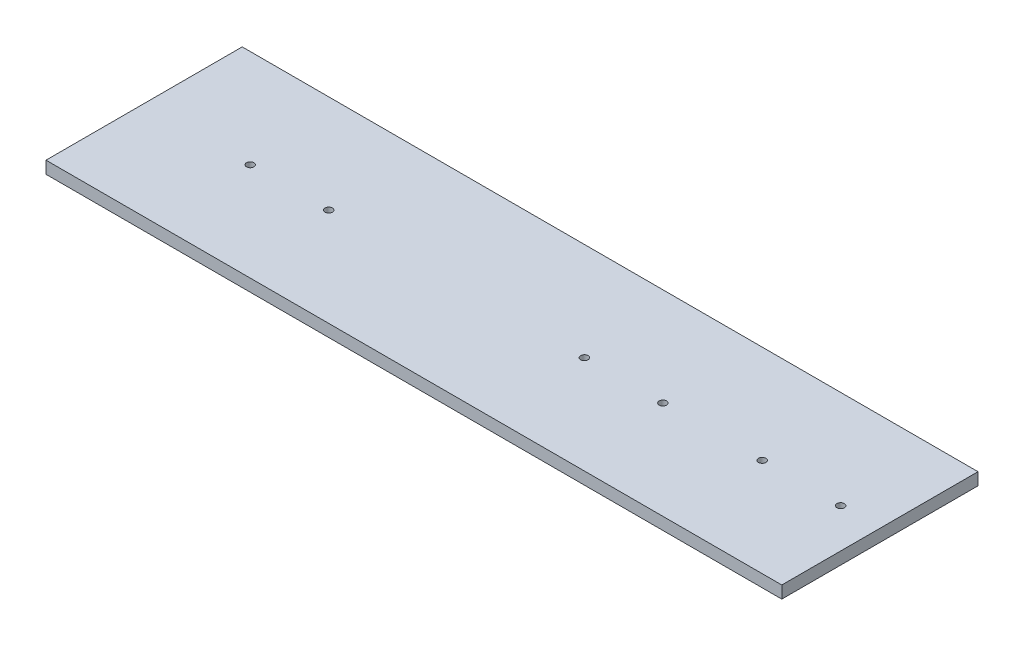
from build123d import *

# Parameters (mm, degrees)
SKETCH1_W           = 600
SKETCH1_H           = 160
BOSS_EXTRUDE1_DEPTH = 10
SKETCH2_R           = 3
CUT_EXTRUDE1_DEPTH  = 10


with BuildPart() as part:
    # Sketch1 → Boss-Extrude1 (new body)
    with BuildSketch(Plane(origin=(0, 0, 0), x_dir=(1, 0, 0), z_dir=(0, 1, 0))):
        Rectangle(SKETCH1_W, SKETCH1_H)
    extrude(amount=BOSS_EXTRUDE1_DEPTH)

    # Sketch2 → Cut-Extrude1 (cut)
    with BuildSketch(Plane.XZ):
        with Locations(Location((-213.473266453, 0, 0), (0, 0, 270))):
            Circle(SKETCH2_R)
        with Locations(Location((-149.473266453, 0, 0), (0, 0, 270))):
            Circle(SKETCH2_R)
        with Locations(Location((59, 0, 0), (0, 0, 270))):
            Circle(SKETCH2_R)
        with Locations(Location((123, 0, 0), (0, 0, 270))):
            Circle(SKETCH2_R)
        with Locations(Location((204, 0, 0), (0, 0, 270))):
            Circle(SKETCH2_R)
        with Locations(Location((268, 0, 0), (0, 0, 270))):
            Circle(SKETCH2_R)
    extrude(amount=-CUT_EXTRUDE1_DEPTH, mode=Mode.SUBTRACT)


solid = part.part
